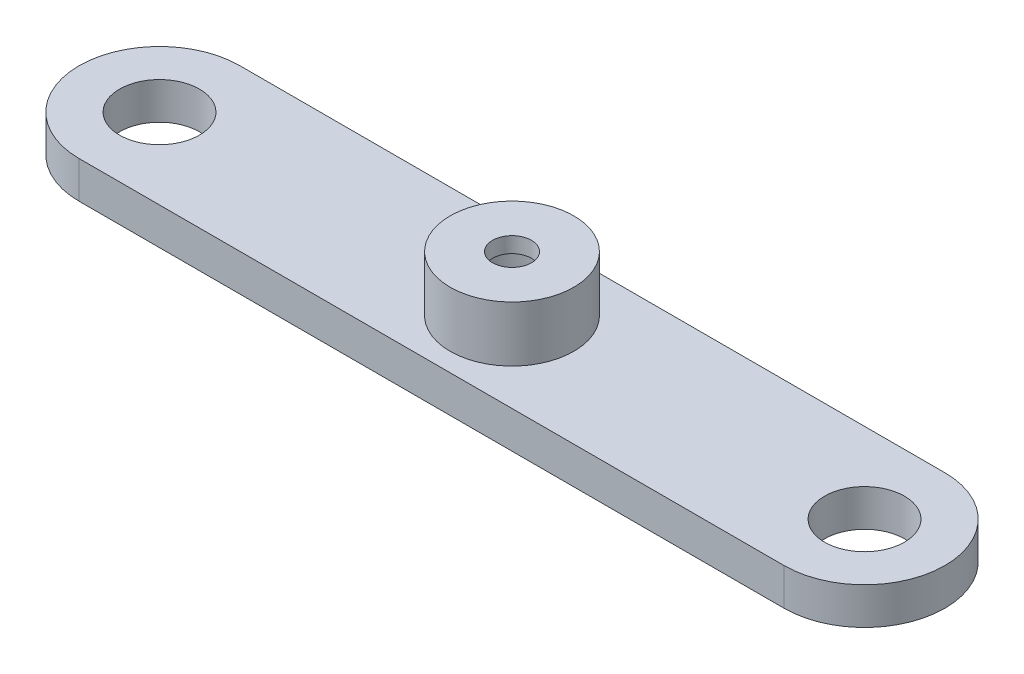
ISO-10303-21;
HEADER;
FILE_DESCRIPTION(('STEP AP214'),'2;1');
FILE_NAME('part.step','',(''),(''),'','','');
FILE_SCHEMA(('AUTOMOTIVE_DESIGN { 1 0 10303 214 1 1 1 1 }'));
ENDSEC;
DATA;
#1=APPLICATION_CONTEXT('core data for automotive mechanical design processes');
#2=APPLICATION_PROTOCOL_DEFINITION('international standard','automotive_design',2000,#1);
#3=PRODUCT_CONTEXT('',#1,'mechanical');
#4=PRODUCT('Part','Part','',(#3));
#5=PRODUCT_RELATED_PRODUCT_CATEGORY('part','',(#4));
#6=PRODUCT_DEFINITION_FORMATION('','',#4);
#7=PRODUCT_DEFINITION_CONTEXT('part definition',#1,'design');
#8=PRODUCT_DEFINITION('design','',#6,#7);
#9=PRODUCT_DEFINITION_SHAPE('','',#8);
#10=(LENGTH_UNIT() NAMED_UNIT(*) SI_UNIT(.MILLI.,.METRE.));
#11=(NAMED_UNIT(*) PLANE_ANGLE_UNIT() SI_UNIT($,.RADIAN.));
#12=(NAMED_UNIT(*) SI_UNIT($,.STERADIAN.) SOLID_ANGLE_UNIT());
#13=UNCERTAINTY_MEASURE_WITH_UNIT(LENGTH_MEASURE(1.E-05),#10,'distance_accuracy_value','');
#14=(GEOMETRIC_REPRESENTATION_CONTEXT(3) GLOBAL_UNCERTAINTY_ASSIGNED_CONTEXT((#13)) GLOBAL_UNIT_ASSIGNED_CONTEXT((#10,
#11,#12)) REPRESENTATION_CONTEXT('',''));
#15=CARTESIAN_POINT('',(0.,0.,0.));
#16=DIRECTION('',(0.,0.,1.));
#17=DIRECTION('',(1.,0.,0.));
#18=AXIS2_PLACEMENT_3D('',#15,#16,#17);
#19=CARTESIAN_POINT('',(0.,0.,0.));
#20=DIRECTION('',(0.,1.,0.));
#21=DIRECTION('',(0.,0.,1.));
#22=AXIS2_PLACEMENT_3D('',#19,#20,#21);
#23=PLANE('',#22);
#24=CARTESIAN_POINT('',(0.,0.,0.));
#25=DIRECTION('',(0.,1.,0.));
#26=DIRECTION('',(0.,0.,1.));
#27=AXIS2_PLACEMENT_3D('',#24,#25,#26);
#28=CIRCLE('',#27,2.44856);
#29=CARTESIAN_POINT('',(0.,0.,2.44856));
#30=VERTEX_POINT('',#29);
#31=EDGE_CURVE('E11',#30,#30,#28,.T.);
#32=ORIENTED_EDGE('',*,*,#31,.T.);
#33=EDGE_LOOP('',(#32));
#34=FACE_BOUND('',#33,.T.);
#35=CARTESIAN_POINT('',(18.0975,0.,0.));
#36=DIRECTION('',(0.,1.,0.));
#37=DIRECTION('',(0.,0.,1.));
#38=AXIS2_PLACEMENT_3D('',#35,#36,#37);
#39=CIRCLE('',#38,4.12750000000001);
#40=CARTESIAN_POINT('',(18.0975,0.,4.12750000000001));
#41=VERTEX_POINT('',#40);
#42=CARTESIAN_POINT('',(18.0975,0.,-4.12750000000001));
#43=VERTEX_POINT('',#42);
#44=EDGE_CURVE('E108',#41,#43,#39,.T.);
#45=ORIENTED_EDGE('',*,*,#44,.F.);
#46=DIRECTION('',(1.,0.,0.));
#47=VECTOR('',#46,1.);
#48=CARTESIAN_POINT('',(18.0975,0.,4.12750000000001));
#49=LINE('',#48,#47);
#50=CARTESIAN_POINT('',(-18.0975,0.,4.12750000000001));
#51=VERTEX_POINT('',#50);
#52=EDGE_CURVE('E79',#51,#41,#49,.T.);
#53=ORIENTED_EDGE('',*,*,#52,.F.);
#54=CARTESIAN_POINT('',(-18.0975,0.,0.));
#55=DIRECTION('',(0.,1.,0.));
#56=DIRECTION('',(0.,0.,1.));
#57=AXIS2_PLACEMENT_3D('',#54,#55,#56);
#58=CIRCLE('',#57,4.12750000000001);
#59=CARTESIAN_POINT('',(-18.0975,0.,-4.1275));
#60=VERTEX_POINT('',#59);
#61=EDGE_CURVE('E73',#60,#51,#58,.T.);
#62=ORIENTED_EDGE('',*,*,#61,.F.);
#63=DIRECTION('',(-1.,0.,0.));
#64=VECTOR('',#63,1.);
#65=CARTESIAN_POINT('',(18.0975,0.,-4.12750000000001));
#66=LINE('',#65,#64);
#67=EDGE_CURVE('E98',#43,#60,#66,.T.);
#68=ORIENTED_EDGE('',*,*,#67,.F.);
#69=EDGE_LOOP('',(#45,#53,#62,#68));
#70=FACE_BOUND('',#69,.T.);
#71=CARTESIAN_POINT('',(-18.0975,0.,0.));
#72=DIRECTION('',(0.,1.,0.));
#73=DIRECTION('',(0.,0.,1.));
#74=AXIS2_PLACEMENT_3D('',#71,#72,#73);
#75=CIRCLE('',#74,2.05);
#76=CARTESIAN_POINT('',(-18.0975,0.,-2.04999999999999));
#77=VERTEX_POINT('',#76);
#78=EDGE_CURVE('E158',#77,#77,#75,.T.);
#79=ORIENTED_EDGE('',*,*,#78,.T.);
#80=EDGE_LOOP('',(#79));
#81=FACE_BOUND('',#80,.T.);
#82=CARTESIAN_POINT('',(18.0975,0.,0.));
#83=DIRECTION('',(0.,1.,0.));
#84=DIRECTION('',(0.,0.,1.));
#85=AXIS2_PLACEMENT_3D('',#82,#83,#84);
#86=CIRCLE('',#85,2.05);
#87=CARTESIAN_POINT('',(18.0975,0.,-2.05));
#88=VERTEX_POINT('',#87);
#89=EDGE_CURVE('E161',#88,#88,#86,.T.);
#90=ORIENTED_EDGE('',*,*,#89,.T.);
#91=EDGE_LOOP('',(#90));
#92=FACE_BOUND('',#91,.T.);
#93=ADVANCED_FACE('F39',(#34,#70,#81,#92),#23,.F.);
#94=CARTESIAN_POINT('',(0.,3.95,0.));
#95=DIRECTION('',(0.,-1.,0.));
#96=DIRECTION('',(0.,0.,-1.));
#97=AXIS2_PLACEMENT_3D('',#94,#95,#96);
#98=CYLINDRICAL_SURFACE('',#97,3.175);
#99=CARTESIAN_POINT('',(0.,1.9,0.));
#100=DIRECTION('',(0.,1.,0.));
#101=DIRECTION('',(0.,0.,1.));
#102=AXIS2_PLACEMENT_3D('',#99,#100,#101);
#103=CIRCLE('',#102,3.175);
#104=CARTESIAN_POINT('',(0.,1.9,3.175));
#105=VERTEX_POINT('',#104);
#106=EDGE_CURVE('E111',#105,#105,#103,.T.);
#107=ORIENTED_EDGE('',*,*,#106,.T.);
#108=EDGE_LOOP('',(#107));
#109=FACE_BOUND('',#108,.T.);
#110=CARTESIAN_POINT('',(0.,4.75,0.));
#111=DIRECTION('',(0.,1.,0.));
#112=DIRECTION('',(0.,0.,1.));
#113=AXIS2_PLACEMENT_3D('',#110,#111,#112);
#114=CIRCLE('',#113,3.175);
#115=CARTESIAN_POINT('',(0.,4.75,3.175));
#116=VERTEX_POINT('',#115);
#117=EDGE_CURVE('E122',#116,#116,#114,.T.);
#118=ORIENTED_EDGE('',*,*,#117,.F.);
#119=EDGE_LOOP('',(#118));
#120=FACE_BOUND('',#119,.T.);
#121=ADVANCED_FACE('F41',(#109,#120),#98,.T.);
#122=CARTESIAN_POINT('',(0.,3.95,0.));
#123=DIRECTION('',(0.,-1.,0.));
#124=DIRECTION('',(0.,0.,-1.));
#125=AXIS2_PLACEMENT_3D('',#122,#123,#124);
#126=CYLINDRICAL_SURFACE('',#125,2.44856);
#127=CARTESIAN_POINT('',(0.,3.95,0.));
#128=DIRECTION('',(0.,1.,0.));
#129=DIRECTION('',(0.,0.,1.));
#130=AXIS2_PLACEMENT_3D('',#127,#128,#129);
#131=CIRCLE('',#130,2.44856);
#132=CARTESIAN_POINT('',(0.,3.95,2.44856));
#133=VERTEX_POINT('',#132);
#134=EDGE_CURVE('E48',#133,#133,#131,.T.);
#135=ORIENTED_EDGE('',*,*,#134,.T.);
#136=EDGE_LOOP('',(#135));
#137=FACE_BOUND('',#136,.T.);
#138=ORIENTED_EDGE('',*,*,#31,.F.);
#139=EDGE_LOOP('',(#138));
#140=FACE_BOUND('',#139,.T.);
#141=ADVANCED_FACE('F129',(#137,#140),#126,.F.);
#142=CARTESIAN_POINT('',(0.,3.95,0.));
#143=DIRECTION('',(0.,1.,0.));
#144=DIRECTION('',(0.,0.,1.));
#145=AXIS2_PLACEMENT_3D('',#142,#143,#144);
#146=PLANE('',#145);
#147=CARTESIAN_POINT('',(0.,3.95,0.));
#148=DIRECTION('',(0.,1.,0.));
#149=DIRECTION('',(0.,0.,1.));
#150=AXIS2_PLACEMENT_3D('',#147,#148,#149);
#151=CIRCLE('',#150,0.999998);
#152=CARTESIAN_POINT('',(0.,3.95,0.999998));
#153=VERTEX_POINT('',#152);
#154=EDGE_CURVE('E118',#153,#153,#151,.T.);
#155=ORIENTED_EDGE('',*,*,#154,.T.);
#156=EDGE_LOOP('',(#155));
#157=FACE_BOUND('',#156,.T.);
#158=ORIENTED_EDGE('',*,*,#134,.F.);
#159=EDGE_LOOP('',(#158));
#160=FACE_BOUND('',#159,.T.);
#161=ADVANCED_FACE('F132',(#157,#160),#146,.F.);
#162=CARTESIAN_POINT('',(0.,4.75,0.));
#163=DIRECTION('',(0.,1.,0.));
#164=DIRECTION('',(0.,0.,1.));
#165=AXIS2_PLACEMENT_3D('',#162,#163,#164);
#166=PLANE('',#165);
#167=ORIENTED_EDGE('',*,*,#117,.T.);
#168=EDGE_LOOP('',(#167));
#169=FACE_BOUND('',#168,.T.);
#170=CARTESIAN_POINT('',(0.,4.75,0.));
#171=DIRECTION('',(0.,1.,0.));
#172=DIRECTION('',(0.,0.,1.));
#173=AXIS2_PLACEMENT_3D('',#170,#171,#172);
#174=CIRCLE('',#173,0.999998);
#175=CARTESIAN_POINT('',(0.,4.75,0.999998));
#176=VERTEX_POINT('',#175);
#177=EDGE_CURVE('E119',#176,#176,#174,.T.);
#178=ORIENTED_EDGE('',*,*,#177,.F.);
#179=EDGE_LOOP('',(#178));
#180=FACE_BOUND('',#179,.T.);
#181=ADVANCED_FACE('F134',(#169,#180),#166,.T.);
#182=CARTESIAN_POINT('',(0.,4.75,0.));
#183=DIRECTION('',(0.,-1.,0.));
#184=DIRECTION('',(0.,0.,-1.));
#185=AXIS2_PLACEMENT_3D('',#182,#183,#184);
#186=CYLINDRICAL_SURFACE('',#185,0.999998);
#187=ORIENTED_EDGE('',*,*,#177,.T.);
#188=EDGE_LOOP('',(#187));
#189=FACE_BOUND('',#188,.T.);
#190=ORIENTED_EDGE('',*,*,#154,.F.);
#191=EDGE_LOOP('',(#190));
#192=FACE_BOUND('',#191,.T.);
#193=ADVANCED_FACE('F141',(#189,#192),#186,.F.);
#194=CARTESIAN_POINT('',(18.0975,1.9,0.));
#195=DIRECTION('',(0.,1.,0.));
#196=DIRECTION('',(0.,0.,1.));
#197=AXIS2_PLACEMENT_3D('',#194,#195,#196);
#198=PLANE('',#197);
#199=CARTESIAN_POINT('',(-18.0975,1.9,0.));
#200=DIRECTION('',(0.,1.,0.));
#201=DIRECTION('',(0.,0.,1.));
#202=AXIS2_PLACEMENT_3D('',#199,#200,#201);
#203=CIRCLE('',#202,2.05);
#204=CARTESIAN_POINT('',(-18.0975,1.9,-2.04999999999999));
#205=VERTEX_POINT('',#204);
#206=EDGE_CURVE('E168',#205,#205,#203,.T.);
#207=ORIENTED_EDGE('',*,*,#206,.F.);
#208=EDGE_LOOP('',(#207));
#209=FACE_BOUND('',#208,.T.);
#210=CARTESIAN_POINT('',(18.0975,1.9,0.));
#211=DIRECTION('',(0.,1.,0.));
#212=DIRECTION('',(0.,0.,1.));
#213=AXIS2_PLACEMENT_3D('',#210,#211,#212);
#214=CIRCLE('',#213,4.12750000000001);
#215=CARTESIAN_POINT('',(18.0975,1.9,4.12750000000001));
#216=VERTEX_POINT('',#215);
#217=CARTESIAN_POINT('',(18.0975,1.9,-4.12750000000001));
#218=VERTEX_POINT('',#217);
#219=EDGE_CURVE('E93',#216,#218,#214,.T.);
#220=ORIENTED_EDGE('',*,*,#219,.T.);
#221=DIRECTION('',(-1.,0.,0.));
#222=VECTOR('',#221,1.);
#223=CARTESIAN_POINT('',(18.0975,1.9,-4.12750000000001));
#224=LINE('',#223,#222);
#225=CARTESIAN_POINT('',(-18.0975,1.9,-4.1275));
#226=VERTEX_POINT('',#225);
#227=EDGE_CURVE('E87',#218,#226,#224,.T.);
#228=ORIENTED_EDGE('',*,*,#227,.T.);
#229=CARTESIAN_POINT('',(-18.0975,1.9,0.));
#230=DIRECTION('',(0.,1.,0.));
#231=DIRECTION('',(0.,0.,1.));
#232=AXIS2_PLACEMENT_3D('',#229,#230,#231);
#233=CIRCLE('',#232,4.12750000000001);
#234=CARTESIAN_POINT('',(-18.0975,1.9,4.12750000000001));
#235=VERTEX_POINT('',#234);
#236=EDGE_CURVE('E91',#226,#235,#233,.T.);
#237=ORIENTED_EDGE('',*,*,#236,.T.);
#238=DIRECTION('',(1.,0.,0.));
#239=VECTOR('',#238,1.);
#240=CARTESIAN_POINT('',(18.0975,1.9,4.12750000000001));
#241=LINE('',#240,#239);
#242=EDGE_CURVE('E56',#235,#216,#241,.T.);
#243=ORIENTED_EDGE('',*,*,#242,.T.);
#244=EDGE_LOOP('',(#220,#228,#237,#243));
#245=FACE_BOUND('',#244,.T.);
#246=ORIENTED_EDGE('',*,*,#106,.F.);
#247=EDGE_LOOP('',(#246));
#248=FACE_BOUND('',#247,.T.);
#249=CARTESIAN_POINT('',(18.0975,1.9,0.));
#250=DIRECTION('',(0.,1.,0.));
#251=DIRECTION('',(0.,0.,1.));
#252=AXIS2_PLACEMENT_3D('',#249,#250,#251);
#253=CIRCLE('',#252,2.05);
#254=CARTESIAN_POINT('',(18.0975,1.9,-2.05));
#255=VERTEX_POINT('',#254);
#256=EDGE_CURVE('E163',#255,#255,#253,.T.);
#257=ORIENTED_EDGE('',*,*,#256,.F.);
#258=EDGE_LOOP('',(#257));
#259=FACE_BOUND('',#258,.T.);
#260=ADVANCED_FACE('F88',(#209,#245,#248,#259),#198,.T.);
#261=CARTESIAN_POINT('',(18.0975,1.9,0.));
#262=DIRECTION('',(0.,-1.,0.));
#263=DIRECTION('',(0.,0.,-1.));
#264=AXIS2_PLACEMENT_3D('',#261,#262,#263);
#265=CYLINDRICAL_SURFACE('',#264,4.12750000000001);
#266=ORIENTED_EDGE('',*,*,#44,.T.);
#267=DIRECTION('',(0.,-1.,0.));
#268=VECTOR('',#267,1.);
#269=CARTESIAN_POINT('',(18.0975,1.9,-4.12750000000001));
#270=LINE('',#269,#268);
#271=EDGE_CURVE('E99',#218,#43,#270,.T.);
#272=ORIENTED_EDGE('',*,*,#271,.F.);
#273=ORIENTED_EDGE('',*,*,#219,.F.);
#274=DIRECTION('',(0.,-1.,0.));
#275=VECTOR('',#274,1.);
#276=CARTESIAN_POINT('',(18.0975,1.9,4.12750000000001));
#277=LINE('',#276,#275);
#278=EDGE_CURVE('E104',#216,#41,#277,.T.);
#279=ORIENTED_EDGE('',*,*,#278,.T.);
#280=EDGE_LOOP('',(#266,#272,#273,#279));
#281=FACE_BOUND('',#280,.T.);
#282=ADVANCED_FACE('F177',(#281),#265,.T.);
#283=CARTESIAN_POINT('',(18.0975,1.9,-4.12750000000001));
#284=DIRECTION('',(0.,0.,1.));
#285=DIRECTION('',(1.,0.,0.));
#286=AXIS2_PLACEMENT_3D('',#283,#284,#285);
#287=PLANE('',#286);
#288=ORIENTED_EDGE('',*,*,#67,.T.);
#289=DIRECTION('',(0.,-1.,0.));
#290=VECTOR('',#289,1.);
#291=CARTESIAN_POINT('',(-18.0975,1.9,-4.1275));
#292=LINE('',#291,#290);
#293=EDGE_CURVE('E96',#226,#60,#292,.T.);
#294=ORIENTED_EDGE('',*,*,#293,.F.);
#295=ORIENTED_EDGE('',*,*,#227,.F.);
#296=ORIENTED_EDGE('',*,*,#271,.T.);
#297=EDGE_LOOP('',(#288,#294,#295,#296));
#298=FACE_BOUND('',#297,.T.);
#299=ADVANCED_FACE('F97',(#298),#287,.F.);
#300=CARTESIAN_POINT('',(-18.0975,1.9,0.));
#301=DIRECTION('',(0.,-1.,0.));
#302=DIRECTION('',(0.,0.,-1.));
#303=AXIS2_PLACEMENT_3D('',#300,#301,#302);
#304=CYLINDRICAL_SURFACE('',#303,4.12750000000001);
#305=ORIENTED_EDGE('',*,*,#61,.T.);
#306=DIRECTION('',(0.,-1.,0.));
#307=VECTOR('',#306,1.);
#308=CARTESIAN_POINT('',(-18.0975,1.9,4.12750000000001));
#309=LINE('',#308,#307);
#310=EDGE_CURVE('E100',#235,#51,#309,.T.);
#311=ORIENTED_EDGE('',*,*,#310,.F.);
#312=ORIENTED_EDGE('',*,*,#236,.F.);
#313=ORIENTED_EDGE('',*,*,#293,.T.);
#314=EDGE_LOOP('',(#305,#311,#312,#313));
#315=FACE_BOUND('',#314,.T.);
#316=ADVANCED_FACE('F102',(#315),#304,.T.);
#317=CARTESIAN_POINT('',(18.0975,1.9,4.12750000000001));
#318=DIRECTION('',(0.,0.,-1.));
#319=DIRECTION('',(-1.,0.,0.));
#320=AXIS2_PLACEMENT_3D('',#317,#318,#319);
#321=PLANE('',#320);
#322=ORIENTED_EDGE('',*,*,#52,.T.);
#323=ORIENTED_EDGE('',*,*,#278,.F.);
#324=ORIENTED_EDGE('',*,*,#242,.F.);
#325=ORIENTED_EDGE('',*,*,#310,.T.);
#326=EDGE_LOOP('',(#322,#323,#324,#325));
#327=FACE_BOUND('',#326,.T.);
#328=ADVANCED_FACE('F189',(#327),#321,.F.);
#329=CARTESIAN_POINT('',(-18.0975,1.9,0.));
#330=DIRECTION('',(0.,-1.,0.));
#331=DIRECTION('',(0.,0.,-1.));
#332=AXIS2_PLACEMENT_3D('',#329,#330,#331);
#333=CYLINDRICAL_SURFACE('',#332,2.05);
#334=CARTESIAN_POINT('',(-18.0975,1.9,-2.04999999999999));
#335=CARTESIAN_POINT('',(-18.0975,1.88020833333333,-2.04999999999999));
#336=CARTESIAN_POINT('',(-18.0975,1.86041666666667,-2.04999999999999));
#337=CARTESIAN_POINT('',(-18.0975,1.82083333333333,-2.04999999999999));
#338=CARTESIAN_POINT('',(-18.0975,1.80104166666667,-2.04999999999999));
#339=CARTESIAN_POINT('',(-18.0975,1.76145833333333,-2.04999999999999));
#340=CARTESIAN_POINT('',(-18.0975,1.74166666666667,-2.04999999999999));
#341=CARTESIAN_POINT('',(-18.0975,1.70208333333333,-2.04999999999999));
#342=CARTESIAN_POINT('',(-18.0975,1.68229166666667,-2.04999999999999));
#343=CARTESIAN_POINT('',(-18.0975,1.64270833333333,-2.04999999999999));
#344=CARTESIAN_POINT('',(-18.0975,1.62291666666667,-2.04999999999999));
#345=CARTESIAN_POINT('',(-18.0975,1.58333333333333,-2.04999999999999));
#346=CARTESIAN_POINT('',(-18.0975,1.56354166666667,-2.04999999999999));
#347=CARTESIAN_POINT('',(-18.0975,1.52395833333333,-2.04999999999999));
#348=CARTESIAN_POINT('',(-18.0975,1.50416666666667,-2.04999999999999));
#349=CARTESIAN_POINT('',(-18.0975,1.46458333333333,-2.04999999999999));
#350=CARTESIAN_POINT('',(-18.0975,1.44479166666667,-2.04999999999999));
#351=CARTESIAN_POINT('',(-18.0975,1.40520833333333,-2.04999999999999));
#352=CARTESIAN_POINT('',(-18.0975,1.38541666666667,-2.04999999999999));
#353=CARTESIAN_POINT('',(-18.0975,1.34583333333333,-2.04999999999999));
#354=CARTESIAN_POINT('',(-18.0975,1.32604166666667,-2.04999999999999));
#355=CARTESIAN_POINT('',(-18.0975,1.28645833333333,-2.04999999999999));
#356=CARTESIAN_POINT('',(-18.0975,1.26666666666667,-2.04999999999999));
#357=CARTESIAN_POINT('',(-18.0975,1.22708333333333,-2.04999999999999));
#358=CARTESIAN_POINT('',(-18.0975,1.20729166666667,-2.04999999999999));
#359=CARTESIAN_POINT('',(-18.0975,1.16770833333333,-2.04999999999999));
#360=CARTESIAN_POINT('',(-18.0975,1.14791666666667,-2.04999999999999));
#361=CARTESIAN_POINT('',(-18.0975,1.10833333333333,-2.04999999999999));
#362=CARTESIAN_POINT('',(-18.0975,1.08854166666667,-2.04999999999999));
#363=CARTESIAN_POINT('',(-18.0975,1.04895833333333,-2.04999999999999));
#364=CARTESIAN_POINT('',(-18.0975,1.02916666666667,-2.04999999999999));
#365=CARTESIAN_POINT('',(-18.0975,0.989583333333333,-2.04999999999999));
#366=CARTESIAN_POINT('',(-18.0975,0.969791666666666,-2.04999999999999));
#367=CARTESIAN_POINT('',(-18.0975,0.930208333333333,-2.04999999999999));
#368=CARTESIAN_POINT('',(-18.0975,0.910416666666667,-2.04999999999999));
#369=CARTESIAN_POINT('',(-18.0975,0.870833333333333,-2.04999999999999));
#370=CARTESIAN_POINT('',(-18.0975,0.851041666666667,-2.04999999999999));
#371=CARTESIAN_POINT('',(-18.0975,0.811458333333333,-2.04999999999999));
#372=CARTESIAN_POINT('',(-18.0975,0.791666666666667,-2.04999999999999));
#373=CARTESIAN_POINT('',(-18.0975,0.752083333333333,-2.04999999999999));
#374=CARTESIAN_POINT('',(-18.0975,0.732291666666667,-2.04999999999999));
#375=CARTESIAN_POINT('',(-18.0975,0.692708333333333,-2.04999999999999));
#376=CARTESIAN_POINT('',(-18.0975,0.672916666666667,-2.04999999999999));
#377=CARTESIAN_POINT('',(-18.0975,0.633333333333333,-2.04999999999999));
#378=CARTESIAN_POINT('',(-18.0975,0.613541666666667,-2.04999999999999));
#379=CARTESIAN_POINT('',(-18.0975,0.573958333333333,-2.04999999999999));
#380=CARTESIAN_POINT('',(-18.0975,0.554166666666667,-2.04999999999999));
#381=CARTESIAN_POINT('',(-18.0975,0.514583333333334,-2.04999999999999));
#382=CARTESIAN_POINT('',(-18.0975,0.494791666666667,-2.04999999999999));
#383=CARTESIAN_POINT('',(-18.0975,0.455208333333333,-2.04999999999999));
#384=CARTESIAN_POINT('',(-18.0975,0.435416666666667,-2.04999999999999));
#385=CARTESIAN_POINT('',(-18.0975,0.395833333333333,-2.04999999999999));
#386=CARTESIAN_POINT('',(-18.0975,0.376041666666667,-2.04999999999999));
#387=CARTESIAN_POINT('',(-18.0975,0.336458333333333,-2.04999999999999));
#388=CARTESIAN_POINT('',(-18.0975,0.316666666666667,-2.04999999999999));
#389=CARTESIAN_POINT('',(-18.0975,0.277083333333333,-2.04999999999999));
#390=CARTESIAN_POINT('',(-18.0975,0.257291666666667,-2.04999999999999));
#391=CARTESIAN_POINT('',(-18.0975,0.217708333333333,-2.04999999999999));
#392=CARTESIAN_POINT('',(-18.0975,0.197916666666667,-2.04999999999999));
#393=CARTESIAN_POINT('',(-18.0975,0.158333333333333,-2.04999999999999));
#394=CARTESIAN_POINT('',(-18.0975,0.138541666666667,-2.04999999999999));
#395=CARTESIAN_POINT('',(-18.0975,0.0989583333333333,-2.04999999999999));
#396=CARTESIAN_POINT('',(-18.0975,0.0791666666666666,-2.04999999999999));
#397=CARTESIAN_POINT('',(-18.0975,0.0395833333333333,-2.04999999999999));
#398=CARTESIAN_POINT('',(-18.0975,0.0197916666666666,-2.04999999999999));
#399=CARTESIAN_POINT('',(-18.0975,0.,-2.04999999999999));
#400=B_SPLINE_CURVE_WITH_KNOTS('',3,(#334,#335,#336,#337,#338,#339,#340,#341,#342,#343,#344,
#345,#346,#347,#348,#349,#350,#351,#352,#353,#354,#355,#356,#357,#358,#359,#360,#361,#362,#363,
#364,#365,#366,#367,#368,#369,#370,#371,#372,#373,#374,#375,#376,#377,#378,#379,#380,#381,#382,
#383,#384,#385,#386,#387,#388,#389,#390,#391,#392,#393,#394,#395,#396,#397,#398,#399),
.UNSPECIFIED.,.F.,.F.,(4,2,2,2,2,2,2,2,2,2,2,2,2,2,2,2,2,2,2,2,2,2,2,2,2,2,2,2,2,2,2,2,4),(0.,
0.0593750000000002,0.11875,0.178125,0.2375,0.296875,0.35625,0.415625,0.475,0.534375,0.59375,
0.653125,0.7125,0.771875,0.83125,0.890625,0.95,1.009375,1.06875,1.128125,1.1875,1.246875,
1.30625,1.365625,1.425,1.484375,1.54375,1.603125,1.6625,1.721875,1.78125,1.840625,1.9),.UNSPECIFIED.);
#401=EDGE_CURVE('BSEAM184',#205,#77,#400,.T.);
#402=ORIENTED_EDGE('',*,*,#206,.T.);
#403=ORIENTED_EDGE('',*,*,#78,.F.);
#404=ORIENTED_EDGE('',*,*,#401,.T.);
#405=ORIENTED_EDGE('',*,*,#401,.F.);
#406=EDGE_LOOP('',(#402,#404,#403,#405));
#407=FACE_BOUND('',#406,.T.);
#408=ADVANCED_FACE('F184',(#407),#333,.F.);
#409=CARTESIAN_POINT('',(18.0975,1.9,0.));
#410=DIRECTION('',(0.,-1.,0.));
#411=DIRECTION('',(0.,0.,-1.));
#412=AXIS2_PLACEMENT_3D('',#409,#410,#411);
#413=CYLINDRICAL_SURFACE('',#412,2.05);
#414=CARTESIAN_POINT('',(18.0975,1.9,-2.05));
#415=CARTESIAN_POINT('',(18.0975,1.88020833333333,-2.05));
#416=CARTESIAN_POINT('',(18.0975,1.86041666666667,-2.05));
#417=CARTESIAN_POINT('',(18.0975,1.82083333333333,-2.05));
#418=CARTESIAN_POINT('',(18.0975,1.80104166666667,-2.05));
#419=CARTESIAN_POINT('',(18.0975,1.76145833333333,-2.05));
#420=CARTESIAN_POINT('',(18.0975,1.74166666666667,-2.05));
#421=CARTESIAN_POINT('',(18.0975,1.70208333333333,-2.05));
#422=CARTESIAN_POINT('',(18.0975,1.68229166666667,-2.05));
#423=CARTESIAN_POINT('',(18.0975,1.64270833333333,-2.05));
#424=CARTESIAN_POINT('',(18.0975,1.62291666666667,-2.05));
#425=CARTESIAN_POINT('',(18.0975,1.58333333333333,-2.05));
#426=CARTESIAN_POINT('',(18.0975,1.56354166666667,-2.05));
#427=CARTESIAN_POINT('',(18.0975,1.52395833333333,-2.05));
#428=CARTESIAN_POINT('',(18.0975,1.50416666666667,-2.05));
#429=CARTESIAN_POINT('',(18.0975,1.46458333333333,-2.05));
#430=CARTESIAN_POINT('',(18.0975,1.44479166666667,-2.05));
#431=CARTESIAN_POINT('',(18.0975,1.40520833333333,-2.05));
#432=CARTESIAN_POINT('',(18.0975,1.38541666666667,-2.05));
#433=CARTESIAN_POINT('',(18.0975,1.34583333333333,-2.05));
#434=CARTESIAN_POINT('',(18.0975,1.32604166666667,-2.05));
#435=CARTESIAN_POINT('',(18.0975,1.28645833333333,-2.05));
#436=CARTESIAN_POINT('',(18.0975,1.26666666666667,-2.05));
#437=CARTESIAN_POINT('',(18.0975,1.22708333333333,-2.05));
#438=CARTESIAN_POINT('',(18.0975,1.20729166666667,-2.05));
#439=CARTESIAN_POINT('',(18.0975,1.16770833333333,-2.05));
#440=CARTESIAN_POINT('',(18.0975,1.14791666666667,-2.05));
#441=CARTESIAN_POINT('',(18.0975,1.10833333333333,-2.05));
#442=CARTESIAN_POINT('',(18.0975,1.08854166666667,-2.05));
#443=CARTESIAN_POINT('',(18.0975,1.04895833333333,-2.05));
#444=CARTESIAN_POINT('',(18.0975,1.02916666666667,-2.05));
#445=CARTESIAN_POINT('',(18.0975,0.989583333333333,-2.05));
#446=CARTESIAN_POINT('',(18.0975,0.969791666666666,-2.05));
#447=CARTESIAN_POINT('',(18.0975,0.930208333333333,-2.05));
#448=CARTESIAN_POINT('',(18.0975,0.910416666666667,-2.05));
#449=CARTESIAN_POINT('',(18.0975,0.870833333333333,-2.05));
#450=CARTESIAN_POINT('',(18.0975,0.851041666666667,-2.05));
#451=CARTESIAN_POINT('',(18.0975,0.811458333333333,-2.05));
#452=CARTESIAN_POINT('',(18.0975,0.791666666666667,-2.05));
#453=CARTESIAN_POINT('',(18.0975,0.752083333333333,-2.05));
#454=CARTESIAN_POINT('',(18.0975,0.732291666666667,-2.05));
#455=CARTESIAN_POINT('',(18.0975,0.692708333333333,-2.05));
#456=CARTESIAN_POINT('',(18.0975,0.672916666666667,-2.05));
#457=CARTESIAN_POINT('',(18.0975,0.633333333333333,-2.05));
#458=CARTESIAN_POINT('',(18.0975,0.613541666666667,-2.05));
#459=CARTESIAN_POINT('',(18.0975,0.573958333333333,-2.05));
#460=CARTESIAN_POINT('',(18.0975,0.554166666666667,-2.05));
#461=CARTESIAN_POINT('',(18.0975,0.514583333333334,-2.05));
#462=CARTESIAN_POINT('',(18.0975,0.494791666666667,-2.05));
#463=CARTESIAN_POINT('',(18.0975,0.455208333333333,-2.05));
#464=CARTESIAN_POINT('',(18.0975,0.435416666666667,-2.05));
#465=CARTESIAN_POINT('',(18.0975,0.395833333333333,-2.05));
#466=CARTESIAN_POINT('',(18.0975,0.376041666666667,-2.05));
#467=CARTESIAN_POINT('',(18.0975,0.336458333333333,-2.05));
#468=CARTESIAN_POINT('',(18.0975,0.316666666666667,-2.05));
#469=CARTESIAN_POINT('',(18.0975,0.277083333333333,-2.05));
#470=CARTESIAN_POINT('',(18.0975,0.257291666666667,-2.05));
#471=CARTESIAN_POINT('',(18.0975,0.217708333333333,-2.05));
#472=CARTESIAN_POINT('',(18.0975,0.197916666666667,-2.05));
#473=CARTESIAN_POINT('',(18.0975,0.158333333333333,-2.05));
#474=CARTESIAN_POINT('',(18.0975,0.138541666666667,-2.05));
#475=CARTESIAN_POINT('',(18.0975,0.0989583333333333,-2.05));
#476=CARTESIAN_POINT('',(18.0975,0.0791666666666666,-2.05));
#477=CARTESIAN_POINT('',(18.0975,0.0395833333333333,-2.05));
#478=CARTESIAN_POINT('',(18.0975,0.0197916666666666,-2.05));
#479=CARTESIAN_POINT('',(18.0975,0.,-2.05));
#480=B_SPLINE_CURVE_WITH_KNOTS('',3,(#414,#415,#416,#417,#418,#419,#420,#421,#422,#423,#424,
#425,#426,#427,#428,#429,#430,#431,#432,#433,#434,#435,#436,#437,#438,#439,#440,#441,#442,#443,
#444,#445,#446,#447,#448,#449,#450,#451,#452,#453,#454,#455,#456,#457,#458,#459,#460,#461,#462,
#463,#464,#465,#466,#467,#468,#469,#470,#471,#472,#473,#474,#475,#476,#477,#478,#479),
.UNSPECIFIED.,.F.,.F.,(4,2,2,2,2,2,2,2,2,2,2,2,2,2,2,2,2,2,2,2,2,2,2,2,2,2,2,2,2,2,2,2,4),(0.,
0.0593750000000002,0.11875,0.178125,0.2375,0.296875,0.35625,0.415625,0.475,0.534375,0.59375,
0.653125,0.7125,0.771875,0.83125,0.890625,0.95,1.009375,1.06875,1.128125,1.1875,1.246875,
1.30625,1.365625,1.425,1.484375,1.54375,1.603125,1.6625,1.721875,1.78125,1.840625,1.9),.UNSPECIFIED.);
#481=EDGE_CURVE('BSEAM182',#255,#88,#480,.T.);
#482=ORIENTED_EDGE('',*,*,#256,.T.);
#483=ORIENTED_EDGE('',*,*,#89,.F.);
#484=ORIENTED_EDGE('',*,*,#481,.T.);
#485=ORIENTED_EDGE('',*,*,#481,.F.);
#486=EDGE_LOOP('',(#482,#484,#483,#485));
#487=FACE_BOUND('',#486,.T.);
#488=ADVANCED_FACE('F182',(#487),#413,.F.);
#489=CLOSED_SHELL('',(#93,#121,#141,#161,#181,#193,#260,#282,#299,#316,#328,#408,#488));
#490=MANIFOLD_SOLID_BREP('B2',#489);
#491=ADVANCED_BREP_SHAPE_REPRESENTATION('',(#18,#490),#14);
#492=SHAPE_DEFINITION_REPRESENTATION(#9,#491);
ENDSEC;
END-ISO-10303-21;
